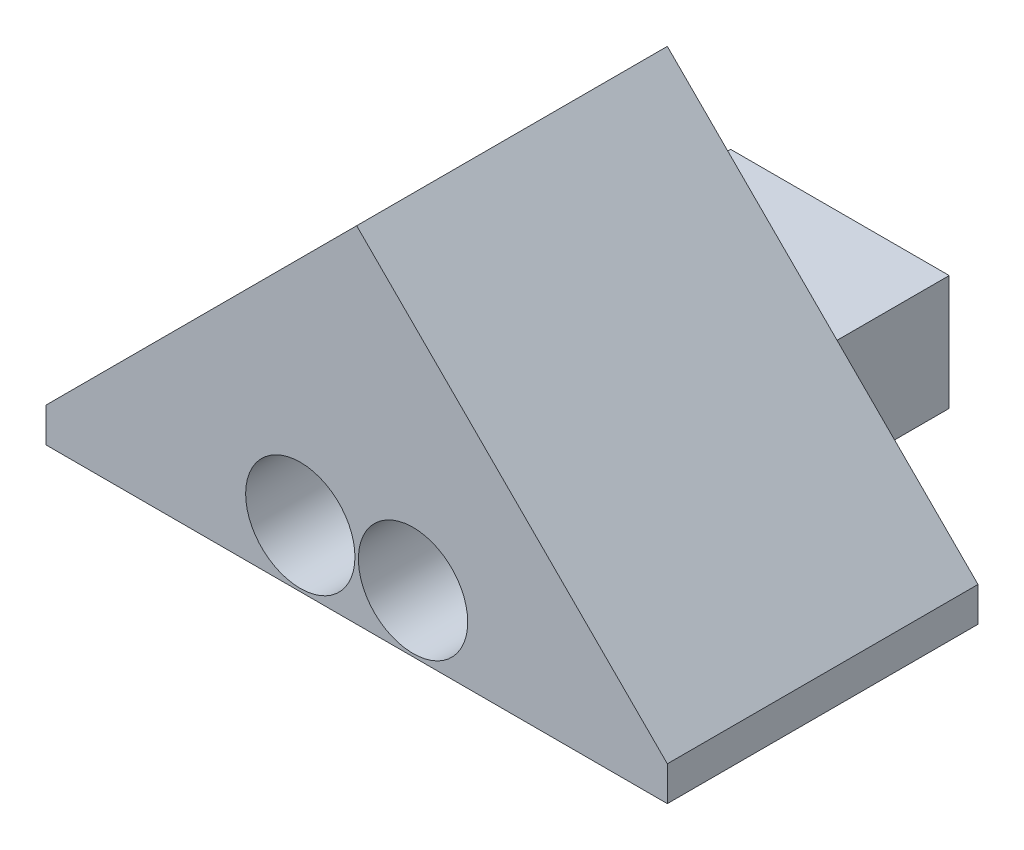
ISO-10303-21;
HEADER;
FILE_DESCRIPTION(('STEP AP214'),'2;1');
FILE_NAME('part.step','',(''),(''),'','','');
FILE_SCHEMA(('AUTOMOTIVE_DESIGN { 1 0 10303 214 1 1 1 1 }'));
ENDSEC;
DATA;
#1=APPLICATION_CONTEXT('core data for automotive mechanical design processes');
#2=APPLICATION_PROTOCOL_DEFINITION('international standard','automotive_design',2000,#1);
#3=PRODUCT_CONTEXT('',#1,'mechanical');
#4=PRODUCT('Part','Part','',(#3));
#5=PRODUCT_RELATED_PRODUCT_CATEGORY('part','',(#4));
#6=PRODUCT_DEFINITION_FORMATION('','',#4);
#7=PRODUCT_DEFINITION_CONTEXT('part definition',#1,'design');
#8=PRODUCT_DEFINITION('design','',#6,#7);
#9=PRODUCT_DEFINITION_SHAPE('','',#8);
#10=(LENGTH_UNIT() NAMED_UNIT(*) SI_UNIT(.MILLI.,.METRE.));
#11=(NAMED_UNIT(*) PLANE_ANGLE_UNIT() SI_UNIT($,.RADIAN.));
#12=(NAMED_UNIT(*) SI_UNIT($,.STERADIAN.) SOLID_ANGLE_UNIT());
#13=UNCERTAINTY_MEASURE_WITH_UNIT(LENGTH_MEASURE(1.E-05),#10,'distance_accuracy_value','');
#14=(GEOMETRIC_REPRESENTATION_CONTEXT(3) GLOBAL_UNCERTAINTY_ASSIGNED_CONTEXT((#13)) GLOBAL_UNIT_ASSIGNED_CONTEXT((#10,
#11,#12)) REPRESENTATION_CONTEXT('',''));
#15=CARTESIAN_POINT('',(0.,0.,0.));
#16=DIRECTION('',(0.,0.,1.));
#17=DIRECTION('',(1.,0.,0.));
#18=AXIS2_PLACEMENT_3D('',#15,#16,#17);
#19=CARTESIAN_POINT('',(-21.5476191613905,22.8327272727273,27.));
#20=DIRECTION('',(1.,0.,0.));
#21=DIRECTION('',(0.,1.,0.));
#22=AXIS2_PLACEMENT_3D('',#19,#20,#21);
#23=PLANE('',#22);
#24=DIRECTION('',(0.,-1.,0.));
#25=VECTOR('',#24,1.);
#26=CARTESIAN_POINT('',(-21.5476191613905,22.8327272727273,27.));
#27=LINE('',#26,#25);
#28=CARTESIAN_POINT('',(-21.5476191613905,-4.16727272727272,27.));
#29=VERTEX_POINT('',#28);
#30=CARTESIAN_POINT('',(-21.5476191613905,-7.16727272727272,27.));
#31=VERTEX_POINT('',#30);
#32=EDGE_CURVE('E243',#29,#31,#27,.T.);
#33=ORIENTED_EDGE('',*,*,#32,.F.);
#34=DIRECTION('',(0.,0.,1.));
#35=VECTOR('',#34,1.);
#36=CARTESIAN_POINT('',(-21.5476191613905,-4.16727272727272,0.));
#37=LINE('',#36,#35);
#38=CARTESIAN_POINT('',(-21.5476191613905,-4.16727272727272,0.));
#39=VERTEX_POINT('',#38);
#40=EDGE_CURVE('E233',#39,#29,#37,.T.);
#41=ORIENTED_EDGE('',*,*,#40,.F.);
#42=DIRECTION('',(0.,-1.,0.));
#43=VECTOR('',#42,1.);
#44=CARTESIAN_POINT('',(-21.5476191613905,22.8327272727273,0.));
#45=LINE('',#44,#43);
#46=CARTESIAN_POINT('',(-21.5476191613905,-7.16727272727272,0.));
#47=VERTEX_POINT('',#46);
#48=EDGE_CURVE('E240',#39,#47,#45,.T.);
#49=ORIENTED_EDGE('',*,*,#48,.T.);
#50=DIRECTION('',(0.,0.,-1.));
#51=VECTOR('',#50,1.);
#52=CARTESIAN_POINT('',(-21.5476191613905,-7.16727272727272,27.));
#53=LINE('',#52,#51);
#54=EDGE_CURVE('E11',#31,#47,#53,.T.);
#55=ORIENTED_EDGE('',*,*,#54,.F.);
#56=EDGE_LOOP('',(#33,#41,#49,#55));
#57=FACE_BOUND('',#56,.T.);
#58=ADVANCED_FACE('F39',(#57),#23,.F.);
#59=CARTESIAN_POINT('',(-21.5476191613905,-7.16727272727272,27.));
#60=DIRECTION('',(0.,1.,0.));
#61=DIRECTION('',(0.,0.,1.));
#62=AXIS2_PLACEMENT_3D('',#59,#60,#61);
#63=PLANE('',#62);
#64=DIRECTION('',(1.,0.,0.));
#65=VECTOR('',#64,1.);
#66=CARTESIAN_POINT('',(-21.5476191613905,-7.16727272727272,0.));
#67=LINE('',#66,#65);
#68=CARTESIAN_POINT('',(-4.04761916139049,-7.16727272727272,0.));
#69=VERTEX_POINT('',#68);
#70=EDGE_CURVE('E257',#47,#69,#67,.T.);
#71=ORIENTED_EDGE('',*,*,#70,.T.);
#72=DIRECTION('',(0.,0.,1.));
#73=VECTOR('',#72,1.);
#74=CARTESIAN_POINT('',(-4.04761916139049,-7.16727272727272,-15.));
#75=LINE('',#74,#73);
#76=CARTESIAN_POINT('',(-4.04761916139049,-7.16727272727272,-15.));
#77=VERTEX_POINT('',#76);
#78=EDGE_CURVE('E147',#77,#69,#75,.T.);
#79=ORIENTED_EDGE('',*,*,#78,.F.);
#80=DIRECTION('',(-1.,0.,0.));
#81=VECTOR('',#80,1.);
#82=CARTESIAN_POINT('',(14.9523808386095,-7.16727272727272,-15.));
#83=LINE('',#82,#81);
#84=CARTESIAN_POINT('',(14.9523808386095,-7.16727272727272,-15.));
#85=VERTEX_POINT('',#84);
#86=EDGE_CURVE('E192',#85,#77,#83,.T.);
#87=ORIENTED_EDGE('',*,*,#86,.F.);
#88=DIRECTION('',(0.,0.,1.));
#89=VECTOR('',#88,1.);
#90=CARTESIAN_POINT('',(14.9523808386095,-7.16727272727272,-15.));
#91=LINE('',#90,#89);
#92=CARTESIAN_POINT('',(14.9523808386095,-7.16727272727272,0.));
#93=VERTEX_POINT('',#92);
#94=EDGE_CURVE('E213',#85,#93,#91,.T.);
#95=ORIENTED_EDGE('',*,*,#94,.T.);
#96=CARTESIAN_POINT('',(32.4523808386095,-7.16727272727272,0.));
#97=VERTEX_POINT('',#96);
#98=EDGE_CURVE('E256',#93,#97,#67,.T.);
#99=ORIENTED_EDGE('',*,*,#98,.T.);
#100=DIRECTION('',(0.,0.,-1.));
#101=VECTOR('',#100,1.);
#102=CARTESIAN_POINT('',(32.4523808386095,-7.16727272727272,27.));
#103=LINE('',#102,#101);
#104=CARTESIAN_POINT('',(32.4523808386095,-7.16727272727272,27.));
#105=VERTEX_POINT('',#104);
#106=EDGE_CURVE('E47',#105,#97,#103,.T.);
#107=ORIENTED_EDGE('',*,*,#106,.F.);
#108=DIRECTION('',(1.,0.,0.));
#109=VECTOR('',#108,1.);
#110=CARTESIAN_POINT('',(-21.5476191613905,-7.16727272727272,27.));
#111=LINE('',#110,#109);
#112=EDGE_CURVE('E246',#31,#105,#111,.T.);
#113=ORIENTED_EDGE('',*,*,#112,.F.);
#114=ORIENTED_EDGE('',*,*,#54,.T.);
#115=EDGE_LOOP('',(#71,#79,#87,#95,#99,#107,#113,#114));
#116=FACE_BOUND('',#115,.T.);
#117=ADVANCED_FACE('F285',(#116),#63,.F.);
#118=CARTESIAN_POINT('',(32.4523808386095,22.8327272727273,27.));
#119=DIRECTION('',(-1.,0.,0.));
#120=DIRECTION('',(0.,-1.,0.));
#121=AXIS2_PLACEMENT_3D('',#118,#119,#120);
#122=PLANE('',#121);
#123=DIRECTION('',(0.,1.,0.));
#124=VECTOR('',#123,1.);
#125=CARTESIAN_POINT('',(32.4523808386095,22.8327272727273,0.));
#126=LINE('',#125,#124);
#127=CARTESIAN_POINT('',(32.4523808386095,-4.16727272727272,0.));
#128=VERTEX_POINT('',#127);
#129=EDGE_CURVE('E247',#97,#128,#126,.T.);
#130=ORIENTED_EDGE('',*,*,#129,.T.);
#131=DIRECTION('',(0.,0.,1.));
#132=VECTOR('',#131,1.);
#133=CARTESIAN_POINT('',(32.4523808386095,-4.16727272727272,0.));
#134=LINE('',#133,#132);
#135=CARTESIAN_POINT('',(32.4523808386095,-4.16727272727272,27.));
#136=VERTEX_POINT('',#135);
#137=EDGE_CURVE('E222',#128,#136,#134,.T.);
#138=ORIENTED_EDGE('',*,*,#137,.T.);
#139=DIRECTION('',(0.,1.,0.));
#140=VECTOR('',#139,1.);
#141=CARTESIAN_POINT('',(32.4523808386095,22.8327272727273,27.));
#142=LINE('',#141,#140);
#143=EDGE_CURVE('E250',#105,#136,#142,.T.);
#144=ORIENTED_EDGE('',*,*,#143,.F.);
#145=ORIENTED_EDGE('',*,*,#106,.T.);
#146=EDGE_LOOP('',(#130,#138,#144,#145));
#147=FACE_BOUND('',#146,.T.);
#148=ADVANCED_FACE('F268',(#147),#122,.F.);
#149=CARTESIAN_POINT('',(0.,0.,27.));
#150=DIRECTION('',(0.,0.,1.));
#151=DIRECTION('',(1.,0.,0.));
#152=AXIS2_PLACEMENT_3D('',#149,#150,#151);
#153=PLANE('',#152);
#154=CARTESIAN_POINT('',(0.552380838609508,-2.16727272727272,27.));
#155=DIRECTION('',(0.,0.,1.));
#156=DIRECTION('',(1.,0.,0.));
#157=AXIS2_PLACEMENT_3D('',#154,#155,#156);
#158=CIRCLE('',#157,4.75);
#159=CARTESIAN_POINT('',(5.30238083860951,-2.16727272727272,27.));
#160=VERTEX_POINT('',#159);
#161=EDGE_CURVE('E180',#160,#160,#158,.T.);
#162=ORIENTED_EDGE('',*,*,#161,.F.);
#163=EDGE_LOOP('',(#162));
#164=FACE_BOUND('',#163,.T.);
#165=CARTESIAN_POINT('',(10.3523808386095,-2.16727272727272,27.));
#166=DIRECTION('',(0.,0.,1.));
#167=DIRECTION('',(1.,0.,0.));
#168=AXIS2_PLACEMENT_3D('',#165,#166,#167);
#169=CIRCLE('',#168,4.75);
#170=CARTESIAN_POINT('',(15.1023808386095,-2.16727272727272,27.));
#171=VERTEX_POINT('',#170);
#172=EDGE_CURVE('E188',#171,#171,#169,.T.);
#173=ORIENTED_EDGE('',*,*,#172,.F.);
#174=EDGE_LOOP('',(#173));
#175=FACE_BOUND('',#174,.T.);
#176=DIRECTION('',(0.707106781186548,-0.707106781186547,0.));
#177=VECTOR('',#176,1.);
#178=CARTESIAN_POINT('',(5.4523808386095,22.8327272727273,27.));
#179=LINE('',#178,#177);
#180=CARTESIAN_POINT('',(5.4523808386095,22.8327272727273,27.));
#181=VERTEX_POINT('',#180);
#182=EDGE_CURVE('E217',#181,#136,#179,.T.);
#183=ORIENTED_EDGE('',*,*,#182,.F.);
#184=DIRECTION('',(0.707106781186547,0.707106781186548,0.));
#185=VECTOR('',#184,1.);
#186=CARTESIAN_POINT('',(-21.5476191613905,-4.16727272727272,27.));
#187=LINE('',#186,#185);
#188=EDGE_CURVE('E228',#29,#181,#187,.T.);
#189=ORIENTED_EDGE('',*,*,#188,.F.);
#190=ORIENTED_EDGE('',*,*,#32,.T.);
#191=ORIENTED_EDGE('',*,*,#112,.T.);
#192=ORIENTED_EDGE('',*,*,#143,.T.);
#193=EDGE_LOOP('',(#183,#189,#190,#191,#192));
#194=FACE_BOUND('',#193,.T.);
#195=ADVANCED_FACE('F282',(#164,#175,#194),#153,.T.);
#196=CARTESIAN_POINT('',(0.,0.,0.));
#197=DIRECTION('',(0.,0.,1.));
#198=DIRECTION('',(1.,0.,0.));
#199=AXIS2_PLACEMENT_3D('',#196,#197,#198);
#200=PLANE('',#199);
#201=DIRECTION('',(0.,1.,0.));
#202=VECTOR('',#201,1.);
#203=CARTESIAN_POINT('',(-4.04761916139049,2.83272727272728,0.));
#204=LINE('',#203,#202);
#205=CARTESIAN_POINT('',(-4.04761916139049,-0.983000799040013,0.));
#206=VERTEX_POINT('',#205);
#207=CARTESIAN_POINT('',(-4.04761916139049,2.83272727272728,0.));
#208=VERTEX_POINT('',#207);
#209=EDGE_CURVE('E127',#206,#208,#204,.T.);
#210=ORIENTED_EDGE('',*,*,#209,.F.);
#211=CARTESIAN_POINT('',(0.552380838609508,-2.16727272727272,0.));
#212=DIRECTION('',(0.,0.,-1.));
#213=DIRECTION('',(-1.,0.,0.));
#214=AXIS2_PLACEMENT_3D('',#211,#212,#213);
#215=CIRCLE('',#214,4.75);
#216=CARTESIAN_POINT('',(-4.04761916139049,-3.35154465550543,0.));
#217=VERTEX_POINT('',#216);
#218=EDGE_CURVE('E132',#217,#206,#215,.T.);
#219=ORIENTED_EDGE('',*,*,#218,.F.);
#220=EDGE_CURVE('E126',#69,#217,#204,.T.);
#221=ORIENTED_EDGE('',*,*,#220,.F.);
#222=ORIENTED_EDGE('',*,*,#70,.F.);
#223=ORIENTED_EDGE('',*,*,#48,.F.);
#224=DIRECTION('',(0.707106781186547,0.707106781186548,0.));
#225=VECTOR('',#224,1.);
#226=CARTESIAN_POINT('',(-21.5476191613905,-4.16727272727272,0.));
#227=LINE('',#226,#225);
#228=CARTESIAN_POINT('',(5.4523808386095,22.8327272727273,0.));
#229=VERTEX_POINT('',#228);
#230=EDGE_CURVE('E229',#39,#229,#227,.T.);
#231=ORIENTED_EDGE('',*,*,#230,.T.);
#232=DIRECTION('',(0.707106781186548,-0.707106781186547,0.));
#233=VECTOR('',#232,1.);
#234=CARTESIAN_POINT('',(5.4523808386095,22.8327272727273,0.));
#235=LINE('',#234,#233);
#236=EDGE_CURVE('E218',#229,#128,#235,.T.);
#237=ORIENTED_EDGE('',*,*,#236,.T.);
#238=ORIENTED_EDGE('',*,*,#129,.F.);
#239=ORIENTED_EDGE('',*,*,#98,.F.);
#240=DIRECTION('',(0.,-1.,0.));
#241=VECTOR('',#240,1.);
#242=CARTESIAN_POINT('',(14.9523808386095,2.83272727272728,0.));
#243=LINE('',#242,#241);
#244=CARTESIAN_POINT('',(14.9523808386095,-3.35154465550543,0.));
#245=VERTEX_POINT('',#244);
#246=EDGE_CURVE('E161',#245,#93,#243,.T.);
#247=ORIENTED_EDGE('',*,*,#246,.F.);
#248=CARTESIAN_POINT('',(10.3523808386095,-2.16727272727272,0.));
#249=DIRECTION('',(0.,0.,-1.));
#250=DIRECTION('',(-1.,0.,0.));
#251=AXIS2_PLACEMENT_3D('',#248,#249,#250);
#252=CIRCLE('',#251,4.75);
#253=CARTESIAN_POINT('',(14.9523808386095,-0.983000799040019,0.));
#254=VERTEX_POINT('',#253);
#255=EDGE_CURVE('E53',#254,#245,#252,.T.);
#256=ORIENTED_EDGE('',*,*,#255,.F.);
#257=CARTESIAN_POINT('',(14.9523808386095,2.83272727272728,0.));
#258=VERTEX_POINT('',#257);
#259=EDGE_CURVE('E156',#258,#254,#243,.T.);
#260=ORIENTED_EDGE('',*,*,#259,.F.);
#261=DIRECTION('',(1.,0.,0.));
#262=VECTOR('',#261,1.);
#263=CARTESIAN_POINT('',(14.9523808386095,2.83272727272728,0.));
#264=LINE('',#263,#262);
#265=EDGE_CURVE('E149',#208,#258,#264,.T.);
#266=ORIENTED_EDGE('',*,*,#265,.F.);
#267=EDGE_LOOP('',(#210,#219,#221,#222,#223,#231,#237,#238,#239,#247,#256,#260,#266));
#268=FACE_BOUND('',#267,.T.);
#269=ADVANCED_FACE('F138',(#268),#200,.F.);
#270=CARTESIAN_POINT('',(-21.5476191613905,-4.16727272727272,0.));
#271=DIRECTION('',(0.707106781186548,-0.707106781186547,0.));
#272=DIRECTION('',(0.707106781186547,0.707106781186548,0.));
#273=AXIS2_PLACEMENT_3D('',#270,#271,#272);
#274=PLANE('',#273);
#275=ORIENTED_EDGE('',*,*,#188,.T.);
#276=DIRECTION('',(0.,0.,1.));
#277=VECTOR('',#276,1.);
#278=CARTESIAN_POINT('',(5.4523808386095,22.8327272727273,0.));
#279=LINE('',#278,#277);
#280=EDGE_CURVE('E237',#229,#181,#279,.T.);
#281=ORIENTED_EDGE('',*,*,#280,.F.);
#282=ORIENTED_EDGE('',*,*,#230,.F.);
#283=ORIENTED_EDGE('',*,*,#40,.T.);
#284=EDGE_LOOP('',(#275,#281,#282,#283));
#285=FACE_BOUND('',#284,.T.);
#286=ADVANCED_FACE('F277',(#285),#274,.F.);
#287=CARTESIAN_POINT('',(5.4523808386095,22.8327272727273,0.));
#288=DIRECTION('',(-0.707106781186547,-0.707106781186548,0.));
#289=DIRECTION('',(0.707106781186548,-0.707106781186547,0.));
#290=AXIS2_PLACEMENT_3D('',#287,#288,#289);
#291=PLANE('',#290);
#292=ORIENTED_EDGE('',*,*,#182,.T.);
#293=ORIENTED_EDGE('',*,*,#137,.F.);
#294=ORIENTED_EDGE('',*,*,#236,.F.);
#295=ORIENTED_EDGE('',*,*,#280,.T.);
#296=EDGE_LOOP('',(#292,#293,#294,#295));
#297=FACE_BOUND('',#296,.T.);
#298=ADVANCED_FACE('F274',(#297),#291,.F.);
#299=CARTESIAN_POINT('',(0.,0.,-15.));
#300=DIRECTION('',(0.,0.,-1.));
#301=DIRECTION('',(-1.,0.,0.));
#302=AXIS2_PLACEMENT_3D('',#299,#300,#301);
#303=PLANE('',#302);
#304=CARTESIAN_POINT('',(10.3523808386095,-2.16727272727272,-15.));
#305=DIRECTION('',(0.,0.,-1.));
#306=DIRECTION('',(-1.,0.,0.));
#307=AXIS2_PLACEMENT_3D('',#304,#305,#306);
#308=CIRCLE('',#307,2.);
#309=CARTESIAN_POINT('',(8.35238083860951,-2.16727272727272,-15.));
#310=VERTEX_POINT('',#309);
#311=EDGE_CURVE('E168',#310,#310,#308,.T.);
#312=ORIENTED_EDGE('',*,*,#311,.F.);
#313=EDGE_LOOP('',(#312));
#314=FACE_BOUND('',#313,.T.);
#315=DIRECTION('',(0.,-1.,0.));
#316=VECTOR('',#315,1.);
#317=CARTESIAN_POINT('',(14.9523808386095,2.83272727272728,-15.));
#318=LINE('',#317,#316);
#319=CARTESIAN_POINT('',(14.9523808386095,2.83272727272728,-15.));
#320=VERTEX_POINT('',#319);
#321=EDGE_CURVE('E152',#320,#85,#318,.T.);
#322=ORIENTED_EDGE('',*,*,#321,.T.);
#323=ORIENTED_EDGE('',*,*,#86,.T.);
#324=DIRECTION('',(0.,1.,0.));
#325=VECTOR('',#324,1.);
#326=CARTESIAN_POINT('',(-4.04761916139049,2.83272727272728,-15.));
#327=LINE('',#326,#325);
#328=CARTESIAN_POINT('',(-4.04761916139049,2.83272727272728,-15.));
#329=VERTEX_POINT('',#328);
#330=EDGE_CURVE('E195',#77,#329,#327,.T.);
#331=ORIENTED_EDGE('',*,*,#330,.T.);
#332=DIRECTION('',(1.,0.,0.));
#333=VECTOR('',#332,1.);
#334=CARTESIAN_POINT('',(14.9523808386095,2.83272727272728,-15.));
#335=LINE('',#334,#333);
#336=EDGE_CURVE('E197',#329,#320,#335,.T.);
#337=ORIENTED_EDGE('',*,*,#336,.T.);
#338=EDGE_LOOP('',(#322,#323,#331,#337));
#339=FACE_BOUND('',#338,.T.);
#340=CARTESIAN_POINT('',(0.552380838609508,-2.16727272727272,-15.));
#341=DIRECTION('',(0.,0.,-1.));
#342=DIRECTION('',(-1.,0.,0.));
#343=AXIS2_PLACEMENT_3D('',#340,#341,#342);
#344=CIRCLE('',#343,2.);
#345=CARTESIAN_POINT('',(-1.44761916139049,-2.16727272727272,-15.));
#346=VERTEX_POINT('',#345);
#347=EDGE_CURVE('E174',#346,#346,#344,.T.);
#348=ORIENTED_EDGE('',*,*,#347,.F.);
#349=EDGE_LOOP('',(#348));
#350=FACE_BOUND('',#349,.T.);
#351=ADVANCED_FACE('F286',(#314,#339,#350),#303,.T.);
#352=CARTESIAN_POINT('',(14.9523808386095,2.83272727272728,-15.));
#353=DIRECTION('',(-1.,0.,0.));
#354=DIRECTION('',(0.,-1.,0.));
#355=AXIS2_PLACEMENT_3D('',#352,#353,#354);
#356=PLANE('',#355);
#357=ORIENTED_EDGE('',*,*,#259,.T.);
#358=EDGE_CURVE('E160',#254,#245,#243,.T.);
#359=ORIENTED_EDGE('',*,*,#358,.T.);
#360=ORIENTED_EDGE('',*,*,#246,.T.);
#361=ORIENTED_EDGE('',*,*,#94,.F.);
#362=ORIENTED_EDGE('',*,*,#321,.F.);
#363=DIRECTION('',(0.,0.,1.));
#364=VECTOR('',#363,1.);
#365=CARTESIAN_POINT('',(14.9523808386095,2.83272727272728,-15.));
#366=LINE('',#365,#364);
#367=EDGE_CURVE('E199',#320,#258,#366,.T.);
#368=ORIENTED_EDGE('',*,*,#367,.T.);
#369=EDGE_LOOP('',(#357,#359,#360,#361,#362,#368));
#370=FACE_BOUND('',#369,.T.);
#371=ADVANCED_FACE('F288',(#370),#356,.F.);
#372=CARTESIAN_POINT('',(-4.04761916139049,2.83272727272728,-15.));
#373=DIRECTION('',(1.,0.,0.));
#374=DIRECTION('',(0.,1.,0.));
#375=AXIS2_PLACEMENT_3D('',#372,#373,#374);
#376=PLANE('',#375);
#377=ORIENTED_EDGE('',*,*,#220,.T.);
#378=EDGE_CURVE('E121',#217,#206,#204,.T.);
#379=ORIENTED_EDGE('',*,*,#378,.T.);
#380=ORIENTED_EDGE('',*,*,#209,.T.);
#381=DIRECTION('',(0.,0.,1.));
#382=VECTOR('',#381,1.);
#383=CARTESIAN_POINT('',(-4.04761916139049,2.83272727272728,-15.));
#384=LINE('',#383,#382);
#385=EDGE_CURVE('E204',#329,#208,#384,.T.);
#386=ORIENTED_EDGE('',*,*,#385,.F.);
#387=ORIENTED_EDGE('',*,*,#330,.F.);
#388=ORIENTED_EDGE('',*,*,#78,.T.);
#389=EDGE_LOOP('',(#377,#379,#380,#386,#387,#388));
#390=FACE_BOUND('',#389,.T.);
#391=ADVANCED_FACE('F144',(#390),#376,.F.);
#392=CARTESIAN_POINT('',(14.9523808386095,2.83272727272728,-15.));
#393=DIRECTION('',(0.,-1.,0.));
#394=DIRECTION('',(1.,0.,0.));
#395=AXIS2_PLACEMENT_3D('',#392,#393,#394);
#396=PLANE('',#395);
#397=ORIENTED_EDGE('',*,*,#265,.T.);
#398=ORIENTED_EDGE('',*,*,#367,.F.);
#399=ORIENTED_EDGE('',*,*,#336,.F.);
#400=ORIENTED_EDGE('',*,*,#385,.T.);
#401=EDGE_LOOP('',(#397,#398,#399,#400));
#402=FACE_BOUND('',#401,.T.);
#403=ADVANCED_FACE('F296',(#402),#396,.F.);
#404=CARTESIAN_POINT('',(10.3523808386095,-2.16727272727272,-15.));
#405=DIRECTION('',(0.,0.,1.));
#406=DIRECTION('',(1.,0.,0.));
#407=AXIS2_PLACEMENT_3D('',#404,#405,#406);
#408=CYLINDRICAL_SURFACE('',#407,2.);
#409=ORIENTED_EDGE('',*,*,#311,.T.);
#410=EDGE_LOOP('',(#409));
#411=FACE_BOUND('',#410,.T.);
#412=CARTESIAN_POINT('',(10.3523808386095,-2.16727272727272,0.));
#413=DIRECTION('',(0.,0.,-1.));
#414=DIRECTION('',(-1.,0.,0.));
#415=AXIS2_PLACEMENT_3D('',#412,#413,#414);
#416=CIRCLE('',#415,2.);
#417=CARTESIAN_POINT('',(8.35238083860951,-2.16727272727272,0.));
#418=VERTEX_POINT('',#417);
#419=EDGE_CURVE('E184',#418,#418,#416,.T.);
#420=ORIENTED_EDGE('',*,*,#419,.F.);
#421=EDGE_LOOP('',(#420));
#422=FACE_BOUND('',#421,.T.);
#423=ADVANCED_FACE('F337',(#411,#422),#408,.F.);
#424=CARTESIAN_POINT('',(0.552380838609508,-2.16727272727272,-15.));
#425=DIRECTION('',(0.,0.,1.));
#426=DIRECTION('',(1.,0.,0.));
#427=AXIS2_PLACEMENT_3D('',#424,#425,#426);
#428=CYLINDRICAL_SURFACE('',#427,2.);
#429=ORIENTED_EDGE('',*,*,#347,.T.);
#430=EDGE_LOOP('',(#429));
#431=FACE_BOUND('',#430,.T.);
#432=CARTESIAN_POINT('',(0.552380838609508,-2.16727272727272,0.));
#433=DIRECTION('',(0.,0.,-1.));
#434=DIRECTION('',(-1.,0.,0.));
#435=AXIS2_PLACEMENT_3D('',#432,#433,#434);
#436=CIRCLE('',#435,2.);
#437=CARTESIAN_POINT('',(-1.44761916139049,-2.16727272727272,0.));
#438=VERTEX_POINT('',#437);
#439=EDGE_CURVE('E135',#438,#438,#436,.T.);
#440=ORIENTED_EDGE('',*,*,#439,.F.);
#441=EDGE_LOOP('',(#440));
#442=FACE_BOUND('',#441,.T.);
#443=ADVANCED_FACE('F348',(#431,#442),#428,.F.);
#444=CARTESIAN_POINT('',(0.552380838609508,-2.16727272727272,0.));
#445=DIRECTION('',(0.,0.,-1.));
#446=DIRECTION('',(-1.,0.,0.));
#447=AXIS2_PLACEMENT_3D('',#444,#445,#446);
#448=PLANE('',#447);
#449=ORIENTED_EDGE('',*,*,#439,.T.);
#450=EDGE_LOOP('',(#449));
#451=FACE_BOUND('',#450,.T.);
#452=EDGE_CURVE('E60',#206,#217,#215,.T.);
#453=ORIENTED_EDGE('',*,*,#452,.F.);
#454=ORIENTED_EDGE('',*,*,#378,.F.);
#455=EDGE_LOOP('',(#453,#454));
#456=FACE_BOUND('',#455,.T.);
#457=ADVANCED_FACE('F122',(#451,#456),#448,.F.);
#458=CARTESIAN_POINT('',(0.552380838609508,-2.16727272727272,36.));
#459=DIRECTION('',(0.,0.,-1.));
#460=DIRECTION('',(-1.,0.,0.));
#461=AXIS2_PLACEMENT_3D('',#458,#459,#460);
#462=CYLINDRICAL_SURFACE('',#461,4.75);
#463=ORIENTED_EDGE('',*,*,#161,.T.);
#464=EDGE_LOOP('',(#463));
#465=FACE_BOUND('',#464,.T.);
#466=ORIENTED_EDGE('',*,*,#452,.T.);
#467=ORIENTED_EDGE('',*,*,#218,.T.);
#468=EDGE_LOOP('',(#466,#467));
#469=FACE_BOUND('',#468,.T.);
#470=ADVANCED_FACE('F131',(#465,#469),#462,.F.);
#471=CARTESIAN_POINT('',(10.3523808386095,-2.16727272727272,0.));
#472=DIRECTION('',(0.,0.,-1.));
#473=DIRECTION('',(-1.,0.,0.));
#474=AXIS2_PLACEMENT_3D('',#471,#472,#473);
#475=PLANE('',#474);
#476=ORIENTED_EDGE('',*,*,#419,.T.);
#477=EDGE_LOOP('',(#476));
#478=FACE_BOUND('',#477,.T.);
#479=EDGE_CURVE('E431',#245,#254,#252,.T.);
#480=ORIENTED_EDGE('',*,*,#479,.F.);
#481=ORIENTED_EDGE('',*,*,#358,.F.);
#482=EDGE_LOOP('',(#480,#481));
#483=FACE_BOUND('',#482,.T.);
#484=ADVANCED_FACE('F397',(#478,#483),#475,.F.);
#485=CARTESIAN_POINT('',(10.3523808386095,-2.16727272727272,36.));
#486=DIRECTION('',(0.,0.,-1.));
#487=DIRECTION('',(-1.,0.,0.));
#488=AXIS2_PLACEMENT_3D('',#485,#486,#487);
#489=CYLINDRICAL_SURFACE('',#488,4.75);
#490=ORIENTED_EDGE('',*,*,#172,.T.);
#491=EDGE_LOOP('',(#490));
#492=FACE_BOUND('',#491,.T.);
#493=ORIENTED_EDGE('',*,*,#255,.T.);
#494=ORIENTED_EDGE('',*,*,#479,.T.);
#495=EDGE_LOOP('',(#493,#494));
#496=FACE_BOUND('',#495,.T.);
#497=ADVANCED_FACE('F407',(#492,#496),#489,.F.);
#498=CLOSED_SHELL('',(#58,#117,#148,#195,#269,#286,#298,#351,#371,#391,#403,#423,#443,#457,#470,
#484,#497));
#499=MANIFOLD_SOLID_BREP('B2',#498);
#500=ADVANCED_BREP_SHAPE_REPRESENTATION('',(#18,#499),#14);
#501=SHAPE_DEFINITION_REPRESENTATION(#9,#500);
ENDSEC;
END-ISO-10303-21;
